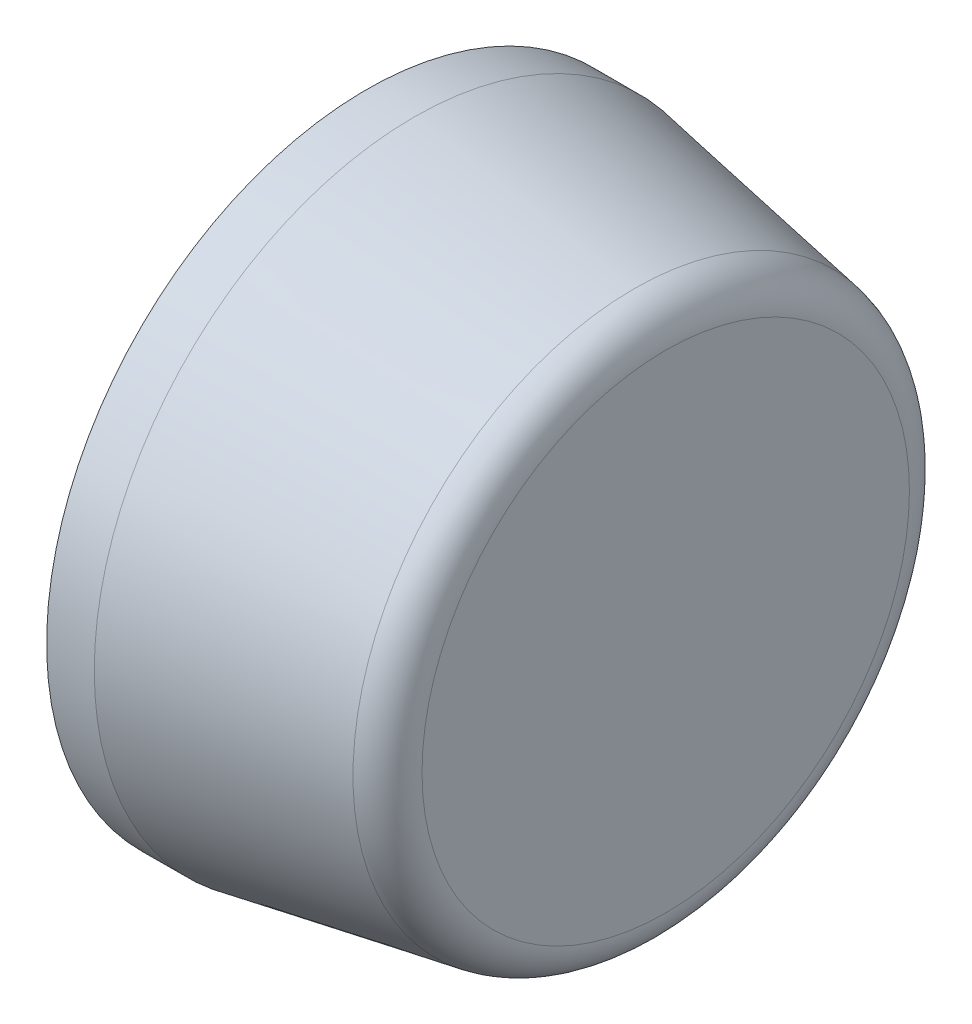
ISO-10303-21;
HEADER;
FILE_DESCRIPTION(('STEP AP214'),'2;1');
FILE_NAME('part.step','',(''),(''),'','','');
FILE_SCHEMA(('AUTOMOTIVE_DESIGN { 1 0 10303 214 1 1 1 1 }'));
ENDSEC;
DATA;
#1=APPLICATION_CONTEXT('core data for automotive mechanical design processes');
#2=APPLICATION_PROTOCOL_DEFINITION('international standard','automotive_design',2000,#1);
#3=PRODUCT_CONTEXT('',#1,'mechanical');
#4=PRODUCT('Part','Part','',(#3));
#5=PRODUCT_RELATED_PRODUCT_CATEGORY('part','',(#4));
#6=PRODUCT_DEFINITION_FORMATION('','',#4);
#7=PRODUCT_DEFINITION_CONTEXT('part definition',#1,'design');
#8=PRODUCT_DEFINITION('design','',#6,#7);
#9=PRODUCT_DEFINITION_SHAPE('','',#8);
#10=(LENGTH_UNIT() NAMED_UNIT(*) SI_UNIT(.MILLI.,.METRE.));
#11=(NAMED_UNIT(*) PLANE_ANGLE_UNIT() SI_UNIT($,.RADIAN.));
#12=(NAMED_UNIT(*) SI_UNIT($,.STERADIAN.) SOLID_ANGLE_UNIT());
#13=UNCERTAINTY_MEASURE_WITH_UNIT(LENGTH_MEASURE(1.E-05),#10,'distance_accuracy_value','');
#14=(GEOMETRIC_REPRESENTATION_CONTEXT(3) GLOBAL_UNCERTAINTY_ASSIGNED_CONTEXT((#13)) GLOBAL_UNIT_ASSIGNED_CONTEXT((#10,
#11,#12)) REPRESENTATION_CONTEXT('',''));
#15=CARTESIAN_POINT('',(0.,0.,0.));
#16=DIRECTION('',(0.,0.,1.));
#17=DIRECTION('',(1.,0.,0.));
#18=AXIS2_PLACEMENT_3D('',#15,#16,#17);
#19=CARTESIAN_POINT('',(27.,8.46622126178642,0.));
#20=DIRECTION('',(-1.,0.,0.));
#21=DIRECTION('',(0.,0.,1.));
#22=AXIS2_PLACEMENT_3D('',#19,#20,#21);
#23=PLANE('',#22);
#24=CARTESIAN_POINT('',(27.,0.,0.));
#25=DIRECTION('',(1.,0.,0.));
#26=DIRECTION('',(0.,0.,1.));
#27=AXIS2_PLACEMENT_3D('',#24,#25,#26);
#28=CIRCLE('',#27,16.9324425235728);
#29=CARTESIAN_POINT('',(27.,0.,-16.9324425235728));
#30=VERTEX_POINT('',#29);
#31=CARTESIAN_POINT('',(27.,0.,16.9324425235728));
#32=VERTEX_POINT('',#31);
#33=EDGE_CURVE('E51',#30,#32,#28,.F.);
#34=ORIENTED_EDGE('',*,*,#33,.T.);
#35=CARTESIAN_POINT('',(27.,0.,0.));
#36=DIRECTION('',(1.,0.,0.));
#37=DIRECTION('',(0.,1.,0.));
#38=AXIS2_PLACEMENT_3D('',#35,#36,#37);
#39=CIRCLE('',#38,16.9324425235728);
#40=CARTESIAN_POINT('',(27.,16.9324425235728,0.));
#41=VERTEX_POINT('',#40);
#42=EDGE_CURVE('E54',#32,#41,#39,.F.);
#43=ORIENTED_EDGE('',*,*,#42,.T.);
#44=CARTESIAN_POINT('',(27.,0.,0.));
#45=DIRECTION('',(1.,0.,0.));
#46=DIRECTION('',(0.,0.,-1.));
#47=AXIS2_PLACEMENT_3D('',#44,#45,#46);
#48=CIRCLE('',#47,16.9324425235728);
#49=EDGE_CURVE('E57',#41,#30,#48,.F.);
#50=ORIENTED_EDGE('',*,*,#49,.T.);
#51=EDGE_LOOP('',(#34,#43,#50));
#52=FACE_BOUND('',#51,.T.);
#53=ADVANCED_FACE('F16',(#52),#23,.T.);
#54=CARTESIAN_POINT('',(25.,0.,0.));
#55=DIRECTION('',(-1.,0.,0.));
#56=DIRECTION('',(0.,0.,1.));
#57=AXIS2_PLACEMENT_3D('',#54,#55,#56);
#58=TOROIDAL_SURFACE('',#57,16.9324425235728,2.);
#59=ORIENTED_EDGE('',*,*,#42,.F.);
#60=ORIENTED_EDGE('',*,*,#33,.F.);
#61=ORIENTED_EDGE('',*,*,#49,.F.);
#62=EDGE_LOOP('',(#59,#60,#61));
#63=FACE_BOUND('',#62,.T.);
#64=CARTESIAN_POINT('',(25.3447173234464,0.,0.));
#65=DIRECTION('',(-1.,0.,0.));
#66=DIRECTION('',(0.,1.,0.));
#67=AXIS2_PLACEMENT_3D('',#64,#65,#66);
#68=CIRCLE('',#67,18.902511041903);
#69=CARTESIAN_POINT('',(25.3447173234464,18.902511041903,0.));
#70=VERTEX_POINT('',#69);
#71=EDGE_CURVE('E90',#70,#70,#68,.T.);
#72=ORIENTED_EDGE('',*,*,#71,.T.);
#73=EDGE_LOOP('',(#72));
#74=FACE_BOUND('',#73,.T.);
#75=ADVANCED_FACE('F63',(#63,#74),#58,.F.);
#76=CARTESIAN_POINT('',(10.5,0.,0.));
#77=DIRECTION('',(-1.,0.,0.));
#78=DIRECTION('',(0.,0.,1.));
#79=AXIS2_PLACEMENT_3D('',#76,#77,#78);
#80=CONICAL_SURFACE('',#79,21.5,0.173223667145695);
#81=ORIENTED_EDGE('',*,*,#71,.F.);
#82=EDGE_LOOP('',(#81));
#83=FACE_BOUND('',#82,.T.);
#84=CARTESIAN_POINT('',(10.5,0.,0.));
#85=DIRECTION('',(1.,0.,0.));
#86=DIRECTION('',(0.,0.,-1.));
#87=AXIS2_PLACEMENT_3D('',#84,#85,#86);
#88=CIRCLE('',#87,21.5);
#89=CARTESIAN_POINT('',(10.5,0.,-21.5));
#90=VERTEX_POINT('',#89);
#91=EDGE_CURVE('E100',#90,#90,#88,.F.);
#92=ORIENTED_EDGE('',*,*,#91,.T.);
#93=EDGE_LOOP('',(#92));
#94=FACE_BOUND('',#93,.T.);
#95=ADVANCED_FACE('F84',(#83,#94),#80,.F.);
#96=CARTESIAN_POINT('',(8.75,0.,0.));
#97=DIRECTION('',(1.,0.,0.));
#98=DIRECTION('',(0.,0.,-1.));
#99=AXIS2_PLACEMENT_3D('',#96,#97,#98);
#100=CYLINDRICAL_SURFACE('',#99,21.5);
#101=ORIENTED_EDGE('',*,*,#91,.F.);
#102=EDGE_LOOP('',(#101));
#103=FACE_BOUND('',#102,.T.);
#104=CARTESIAN_POINT('',(7.,0.,0.));
#105=DIRECTION('',(1.,0.,0.));
#106=DIRECTION('',(0.,0.,-1.));
#107=AXIS2_PLACEMENT_3D('',#104,#105,#106);
#108=CIRCLE('',#107,21.5);
#109=CARTESIAN_POINT('',(7.,0.,-21.5));
#110=VERTEX_POINT('',#109);
#111=EDGE_CURVE('E103',#110,#110,#108,.T.);
#112=ORIENTED_EDGE('',*,*,#111,.F.);
#113=EDGE_LOOP('',(#112));
#114=FACE_BOUND('',#113,.T.);
#115=ADVANCED_FACE('F145',(#103,#114),#100,.F.);
#116=CARTESIAN_POINT('',(29.,8.95515761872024,0.));
#117=DIRECTION('',(1.,0.,0.));
#118=DIRECTION('',(0.,1.,0.));
#119=AXIS2_PLACEMENT_3D('',#116,#117,#118);
#120=PLANE('',#119);
#121=CARTESIAN_POINT('',(29.,0.,0.));
#122=DIRECTION('',(-1.,0.,0.));
#123=DIRECTION('',(0.,0.,1.));
#124=AXIS2_PLACEMENT_3D('',#121,#122,#123);
#125=CIRCLE('',#124,17.9103152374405);
#126=CARTESIAN_POINT('',(29.,0.,17.9103152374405));
#127=VERTEX_POINT('',#126);
#128=CARTESIAN_POINT('',(29.,17.9103152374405,0.));
#129=VERTEX_POINT('',#128);
#130=EDGE_CURVE('E164',#127,#129,#125,.T.);
#131=ORIENTED_EDGE('',*,*,#130,.F.);
#132=CARTESIAN_POINT('',(29.,0.,0.));
#133=DIRECTION('',(-1.,0.,0.));
#134=DIRECTION('',(0.,0.,-1.));
#135=AXIS2_PLACEMENT_3D('',#132,#133,#134);
#136=CIRCLE('',#135,17.9103152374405);
#137=CARTESIAN_POINT('',(29.,0.,-17.9103152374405));
#138=VERTEX_POINT('',#137);
#139=EDGE_CURVE('E156',#138,#127,#136,.T.);
#140=ORIENTED_EDGE('',*,*,#139,.F.);
#141=CARTESIAN_POINT('',(29.,0.,0.));
#142=DIRECTION('',(-1.,0.,0.));
#143=DIRECTION('',(0.,1.,0.));
#144=AXIS2_PLACEMENT_3D('',#141,#142,#143);
#145=CIRCLE('',#144,17.9103152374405);
#146=EDGE_CURVE('E36',#129,#138,#145,.T.);
#147=ORIENTED_EDGE('',*,*,#146,.F.);
#148=EDGE_LOOP('',(#131,#140,#147));
#149=FACE_BOUND('',#148,.T.);
#150=ADVANCED_FACE('F137',(#149),#120,.T.);
#151=CARTESIAN_POINT('',(7.,22.5,0.));
#152=DIRECTION('',(-1.,0.,0.));
#153=DIRECTION('',(0.,0.,1.));
#154=AXIS2_PLACEMENT_3D('',#151,#152,#153);
#155=PLANE('',#154);
#156=CARTESIAN_POINT('',(7.,0.,0.));
#157=DIRECTION('',(1.,0.,0.));
#158=DIRECTION('',(0.,0.,-1.));
#159=AXIS2_PLACEMENT_3D('',#156,#157,#158);
#160=CIRCLE('',#159,23.5);
#161=CARTESIAN_POINT('',(7.,0.,-23.5));
#162=VERTEX_POINT('',#161);
#163=EDGE_CURVE('E73',#162,#162,#160,.T.);
#164=ORIENTED_EDGE('',*,*,#163,.F.);
#165=EDGE_LOOP('',(#164));
#166=FACE_BOUND('',#165,.T.);
#167=ORIENTED_EDGE('',*,*,#111,.T.);
#168=EDGE_LOOP('',(#167));
#169=FACE_BOUND('',#168,.T.);
#170=ADVANCED_FACE('F123',(#166,#169),#155,.T.);
#171=CARTESIAN_POINT('',(26.2,0.,0.));
#172=DIRECTION('',(-1.,0.,0.));
#173=DIRECTION('',(0.,0.,1.));
#174=AXIS2_PLACEMENT_3D('',#171,#172,#173);
#175=TOROIDAL_SURFACE('',#174,17.9103152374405,2.80000000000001);
#176=CARTESIAN_POINT('',(26.682604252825,0.,0.));
#177=DIRECTION('',(-1.,0.,0.));
#178=DIRECTION('',(0.,1.,0.));
#179=AXIS2_PLACEMENT_3D('',#176,#177,#178);
#180=CIRCLE('',#179,20.6684111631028);
#181=CARTESIAN_POINT('',(26.682604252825,20.6684111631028,0.));
#182=VERTEX_POINT('',#181);
#183=EDGE_CURVE('E27',#182,#182,#180,.T.);
#184=ORIENTED_EDGE('',*,*,#183,.F.);
#185=EDGE_LOOP('',(#184));
#186=FACE_BOUND('',#185,.T.);
#187=ORIENTED_EDGE('',*,*,#139,.T.);
#188=ORIENTED_EDGE('',*,*,#130,.T.);
#189=ORIENTED_EDGE('',*,*,#146,.T.);
#190=EDGE_LOOP('',(#187,#188,#189));
#191=FACE_BOUND('',#190,.T.);
#192=ADVANCED_FACE('F111',(#186,#191),#175,.T.);
#193=CARTESIAN_POINT('',(8.75,0.,0.));
#194=DIRECTION('',(1.,0.,0.));
#195=DIRECTION('',(0.,0.,-1.));
#196=AXIS2_PLACEMENT_3D('',#193,#194,#195);
#197=CYLINDRICAL_SURFACE('',#196,23.5);
#198=CARTESIAN_POINT('',(10.5,0.,0.));
#199=DIRECTION('',(-1.,0.,0.));
#200=DIRECTION('',(0.,1.,0.));
#201=AXIS2_PLACEMENT_3D('',#198,#199,#200);
#202=CIRCLE('',#201,23.5);
#203=CARTESIAN_POINT('',(10.5,23.5,0.));
#204=VERTEX_POINT('',#203);
#205=EDGE_CURVE('E11',#204,#204,#202,.F.);
#206=ORIENTED_EDGE('',*,*,#205,.F.);
#207=EDGE_LOOP('',(#206));
#208=FACE_BOUND('',#207,.T.);
#209=ORIENTED_EDGE('',*,*,#163,.T.);
#210=EDGE_LOOP('',(#209));
#211=FACE_BOUND('',#210,.T.);
#212=ADVANCED_FACE('F122',(#208,#211),#197,.T.);
#213=CARTESIAN_POINT('',(10.5,0.,0.));
#214=DIRECTION('',(-1.,0.,0.));
#215=DIRECTION('',(0.,0.,1.));
#216=AXIS2_PLACEMENT_3D('',#213,#214,#215);
#217=CONICAL_SURFACE('',#216,23.5,0.173223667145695);
#218=ORIENTED_EDGE('',*,*,#183,.T.);
#219=EDGE_LOOP('',(#218));
#220=FACE_BOUND('',#219,.T.);
#221=ORIENTED_EDGE('',*,*,#205,.T.);
#222=EDGE_LOOP('',(#221));
#223=FACE_BOUND('',#222,.T.);
#224=ADVANCED_FACE('F195',(#220,#223),#217,.T.);
#225=CLOSED_SHELL('',(#53,#75,#95,#115,#150,#170,#192,#212,#224));
#226=MANIFOLD_SOLID_BREP('B1',#225);
#227=ADVANCED_BREP_SHAPE_REPRESENTATION('',(#18,#226),#14);
#228=SHAPE_DEFINITION_REPRESENTATION(#9,#227);
ENDSEC;
END-ISO-10303-21;
